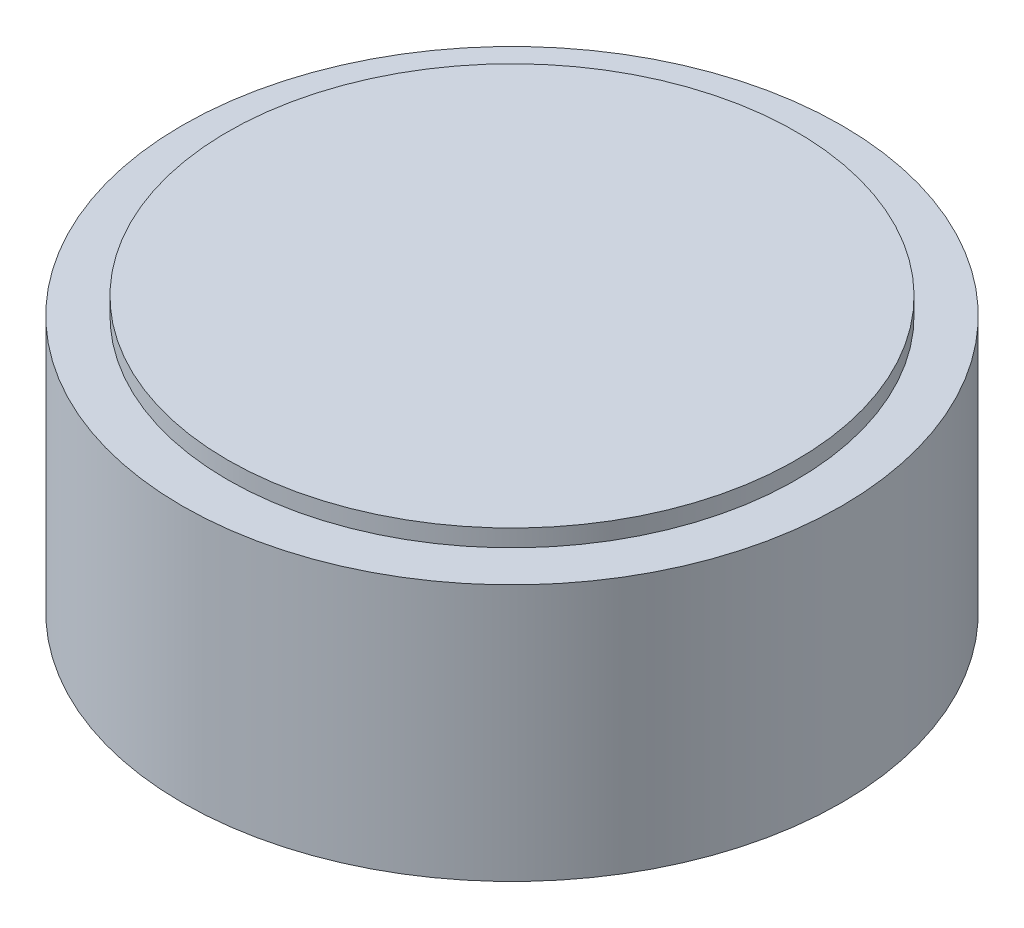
from build123d import *

# Parameters (mm, degrees)
SKETCH2_R                      = 9.625
BOSS_EXTRUDE1_DEPTH            = 4
SKETCH3_R                      = 9.625
SKETCH3_R_2                    = 8.3
CUT_EXTRUDE1_DEPTH             = 0.5
F_1_8_0_1250_DOWEL_HOLE1_D     = 3.175
F_1_8_0_1250_DOWEL_HOLE1_DEPTH = 5


with BuildPart() as part:
    # Sketch2 → Boss-Extrude1 (new, symmetric)
    with BuildSketch(Plane(origin=(0, 0, 0), x_dir=(1, 0, 0), z_dir=(0, 1, 0))):
        with Locations(Location((0, 0, 0), (0, 0, 270))):
            Circle(SKETCH2_R)
    extrude(amount=BOSS_EXTRUDE1_DEPTH, both=True)

    # Sketch3 → Cut-Extrude1 (cut)
    with BuildSketch(Plane(origin=(0, 4, 0), x_dir=(1, 0, 0), z_dir=(0, 1, 0))):
        with Locations(Location((0, 0, 0), (0, 0, 270))):
            Circle(SKETCH3_R)
        with Locations(Location((0, 0, 0), (0, 0, 270))):
            Circle(SKETCH3_R_2, mode=Mode.SUBTRACT)
    extrude(amount=-CUT_EXTRUDE1_DEPTH, mode=Mode.SUBTRACT)

    # 1_8 _0.1250_ Dowel Hole1
    with Locations(Plane(origin=(0, -4, 0), x_dir=(-1, 0, 0), z_dir=(0, -1, 0))):
        with Locations((0, 0)):
            Hole(F_1_8_0_1250_DOWEL_HOLE1_D / 2, depth=F_1_8_0_1250_DOWEL_HOLE1_DEPTH)


solid = part.part
